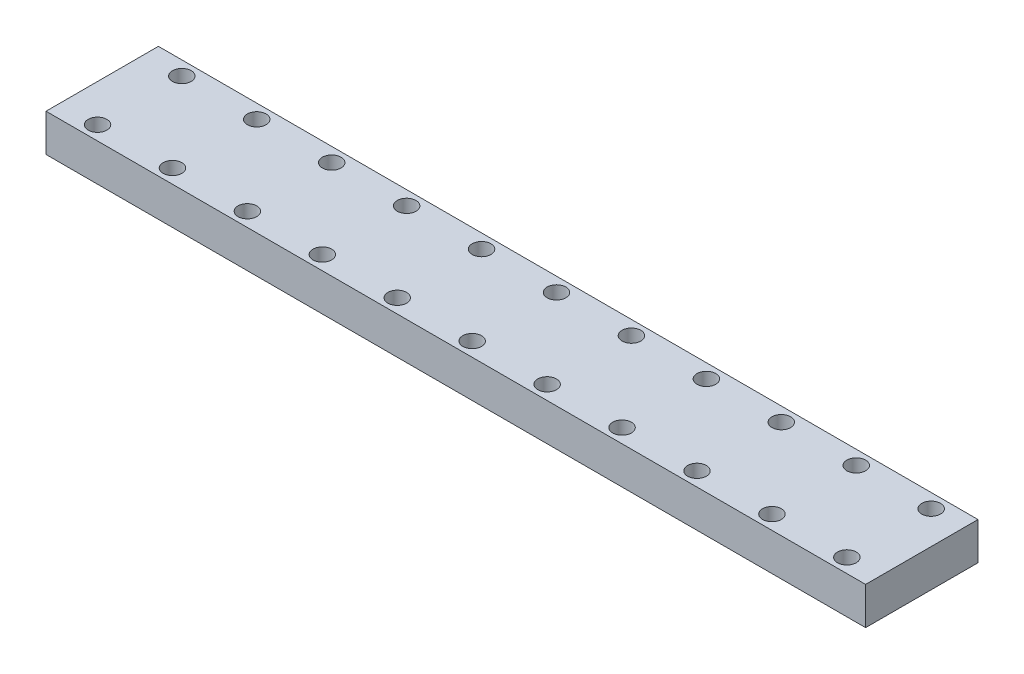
from build123d import *

# Parameters (mm, degrees)
SKETCH_1_W      = 175
SKETCH_1_H      = 24
SKETCH_1_R      = 2
EXTRUDE_1_DEPTH = 8


with BuildPart() as part:
    # Sketch 1 → Extrude 1 (new body)
    with BuildSketch(Plane(origin=(0, 0, 0), x_dir=(1, 0, 0), z_dir=(0, 1, 0))):
        with Locations((69.523529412, -4.611764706)):
            Rectangle(SKETCH_1_W, SKETCH_1_H)
        with Locations(Location((-9.976470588, 4.388235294, 0), (0, 0, 270))):
            Circle(SKETCH_1_R, mode=Mode.SUBTRACT)
        with Locations(Location((6.023529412, 4.388235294, 0), (0, 0, 270))):
            Circle(SKETCH_1_R, mode=Mode.SUBTRACT)
        with Locations(Location((22.023529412, 4.388235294, 0), (0, 0, 270))):
            Circle(SKETCH_1_R, mode=Mode.SUBTRACT)
        with Locations(Location((38.023529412, 4.388235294, 0), (0, 0, 270))):
            Circle(SKETCH_1_R, mode=Mode.SUBTRACT)
        with Locations(Location((54.023529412, 4.388235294, 0), (0, 0, 270))):
            Circle(SKETCH_1_R, mode=Mode.SUBTRACT)
        with Locations(Location((70.023529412, 4.388235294, 0), (0, 0, 270))):
            Circle(SKETCH_1_R, mode=Mode.SUBTRACT)
        with Locations(Location((86.023529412, 4.388235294, 0), (0, 0, 270))):
            Circle(SKETCH_1_R, mode=Mode.SUBTRACT)
        with Locations(Location((102.023529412, 4.388235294, 0), (0, 0, 270))):
            Circle(SKETCH_1_R, mode=Mode.SUBTRACT)
        with Locations(Location((118.023529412, 4.388235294, 0), (0, 0, 270))):
            Circle(SKETCH_1_R, mode=Mode.SUBTRACT)
        with Locations(Location((134.023529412, 4.388235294, 0), (0, 0, 270))):
            Circle(SKETCH_1_R, mode=Mode.SUBTRACT)
        with Locations(Location((150.023529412, 4.388235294, 0), (0, 0, 270))):
            Circle(SKETCH_1_R, mode=Mode.SUBTRACT)
        with Locations(Location((-9.976470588, -13.611764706, 0), (0, 0, 270))):
            Circle(SKETCH_1_R, mode=Mode.SUBTRACT)
        with Locations(Location((6.023529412, -13.611764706, 0), (0, 0, 270))):
            Circle(SKETCH_1_R, mode=Mode.SUBTRACT)
        with Locations(Location((22.023529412, -13.611764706, 0), (0, 0, 270))):
            Circle(SKETCH_1_R, mode=Mode.SUBTRACT)
        with Locations(Location((38.023529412, -13.611764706, 0), (0, 0, 270))):
            Circle(SKETCH_1_R, mode=Mode.SUBTRACT)
        with Locations(Location((54.023529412, -13.611764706, 0), (0, 0, 270))):
            Circle(SKETCH_1_R, mode=Mode.SUBTRACT)
        with Locations(Location((70.023529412, -13.611764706, 0), (0, 0, 270))):
            Circle(SKETCH_1_R, mode=Mode.SUBTRACT)
        with Locations(Location((86.023529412, -13.611764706, 0), (0, 0, 270))):
            Circle(SKETCH_1_R, mode=Mode.SUBTRACT)
        with Locations(Location((102.023529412, -13.611764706, 0), (0, 0, 270))):
            Circle(SKETCH_1_R, mode=Mode.SUBTRACT)
        with Locations(Location((118.023529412, -13.611764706, 0), (0, 0, 270))):
            Circle(SKETCH_1_R, mode=Mode.SUBTRACT)
        with Locations(Location((134.023529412, -13.611764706, 0), (0, 0, 270))):
            Circle(SKETCH_1_R, mode=Mode.SUBTRACT)
        with Locations(Location((150.023529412, -13.611764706, 0), (0, 0, 270))):
            Circle(SKETCH_1_R, mode=Mode.SUBTRACT)
    extrude(amount=EXTRUDE_1_DEPTH)


solid = part.part
